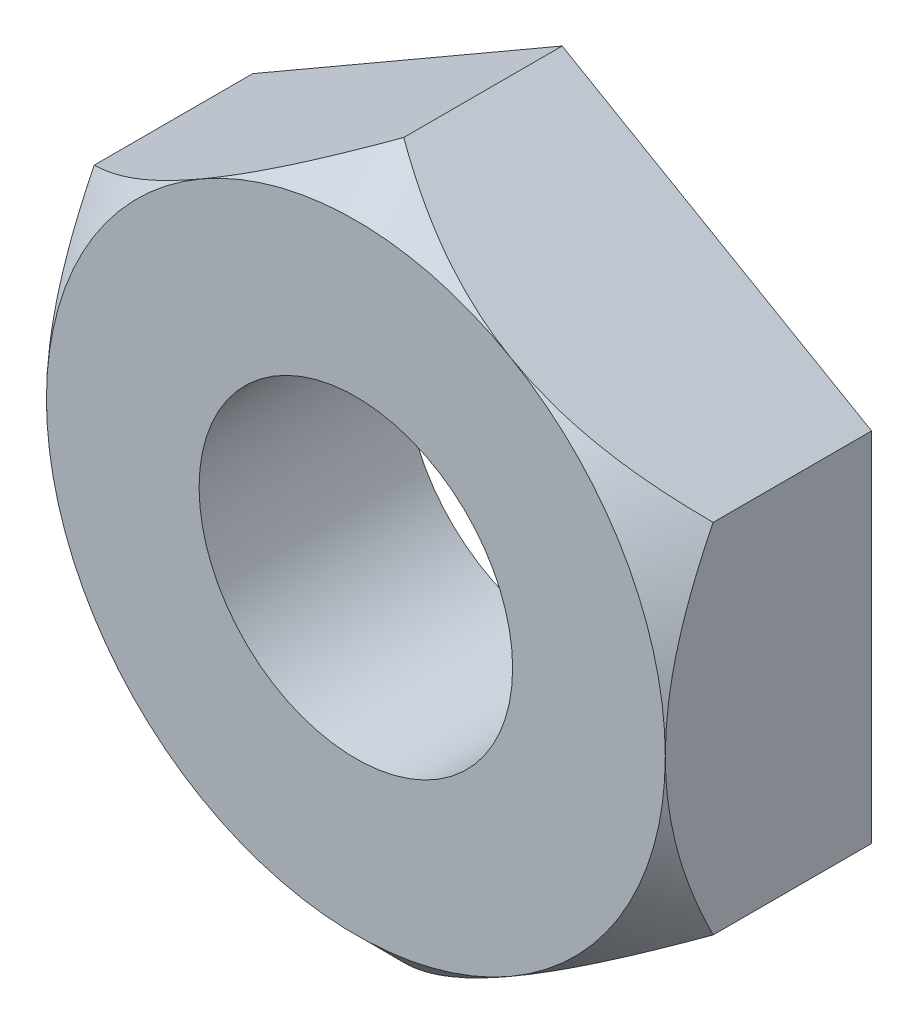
ISO-10303-21;
HEADER;
FILE_DESCRIPTION(('STEP AP214'),'2;1');
FILE_NAME('part.step','',(''),(''),'','','');
FILE_SCHEMA(('AUTOMOTIVE_DESIGN { 1 0 10303 214 1 1 1 1 }'));
ENDSEC;
DATA;
#1=APPLICATION_CONTEXT('core data for automotive mechanical design processes');
#2=APPLICATION_PROTOCOL_DEFINITION('international standard','automotive_design',2000,#1);
#3=PRODUCT_CONTEXT('',#1,'mechanical');
#4=PRODUCT('Part','Part','',(#3));
#5=PRODUCT_RELATED_PRODUCT_CATEGORY('part','',(#4));
#6=PRODUCT_DEFINITION_FORMATION('','',#4);
#7=PRODUCT_DEFINITION_CONTEXT('part definition',#1,'design');
#8=PRODUCT_DEFINITION('design','',#6,#7);
#9=PRODUCT_DEFINITION_SHAPE('','',#8);
#10=(LENGTH_UNIT() NAMED_UNIT(*) SI_UNIT(.MILLI.,.METRE.));
#11=(NAMED_UNIT(*) PLANE_ANGLE_UNIT() SI_UNIT($,.RADIAN.));
#12=(NAMED_UNIT(*) SI_UNIT($,.STERADIAN.) SOLID_ANGLE_UNIT());
#13=UNCERTAINTY_MEASURE_WITH_UNIT(LENGTH_MEASURE(1.E-05),#10,'distance_accuracy_value','');
#14=(GEOMETRIC_REPRESENTATION_CONTEXT(3) GLOBAL_UNCERTAINTY_ASSIGNED_CONTEXT((#13)) GLOBAL_UNIT_ASSIGNED_CONTEXT((#10,
#11,#12)) REPRESENTATION_CONTEXT('',''));
#15=CARTESIAN_POINT('',(0.,0.,0.));
#16=DIRECTION('',(0.,0.,1.));
#17=DIRECTION('',(1.,0.,0.));
#18=AXIS2_PLACEMENT_3D('',#15,#16,#17);
#19=CARTESIAN_POINT('',(4.76249999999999,8.24889197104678,3.175));
#20=DIRECTION('',(0.,0.,1.));
#21=DIRECTION('',(1.,0.,0.));
#22=AXIS2_PLACEMENT_3D('',#19,#20,#21);
#23=PLANE('',#22);
#24=CARTESIAN_POINT('',(0.,0.,3.175));
#25=DIRECTION('',(0.,0.,1.));
#26=DIRECTION('',(1.,0.,0.));
#27=AXIS2_PLACEMENT_3D('',#24,#25,#26);
#28=CIRCLE('',#27,4.7625);
#29=CARTESIAN_POINT('',(2.38125,-4.12444598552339,3.175));
#30=VERTEX_POINT('',#29);
#31=CARTESIAN_POINT('',(4.7625,0.,3.175));
#32=VERTEX_POINT('',#31);
#33=EDGE_CURVE('E139',#30,#32,#28,.T.);
#34=ORIENTED_EDGE('',*,*,#33,.T.);
#35=CARTESIAN_POINT('',(2.38125,4.12444598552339,3.175));
#36=VERTEX_POINT('',#35);
#37=EDGE_CURVE('E122',#32,#36,#28,.T.);
#38=ORIENTED_EDGE('',*,*,#37,.T.);
#39=CARTESIAN_POINT('',(-2.38125,4.12444598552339,3.175));
#40=VERTEX_POINT('',#39);
#41=EDGE_CURVE('E113',#36,#40,#28,.T.);
#42=ORIENTED_EDGE('',*,*,#41,.T.);
#43=CARTESIAN_POINT('',(-4.7625,0.,3.175));
#44=VERTEX_POINT('',#43);
#45=EDGE_CURVE('E123',#40,#44,#28,.T.);
#46=ORIENTED_EDGE('',*,*,#45,.T.);
#47=CARTESIAN_POINT('',(-2.38125,-4.12444598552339,3.175));
#48=VERTEX_POINT('',#47);
#49=EDGE_CURVE('E56',#44,#48,#28,.T.);
#50=ORIENTED_EDGE('',*,*,#49,.T.);
#51=EDGE_CURVE('E64',#48,#30,#28,.T.);
#52=ORIENTED_EDGE('',*,*,#51,.T.);
#53=EDGE_LOOP('',(#34,#38,#42,#46,#50,#52));
#54=FACE_BOUND('',#53,.T.);
#55=CARTESIAN_POINT('',(0.,0.,3.175));
#56=DIRECTION('',(0.,0.,1.));
#57=DIRECTION('',(1.,0.,0.));
#58=AXIS2_PLACEMENT_3D('',#55,#56,#57);
#59=CIRCLE('',#58,2.413);
#60=CARTESIAN_POINT('',(2.413,0.,3.175));
#61=VERTEX_POINT('',#60);
#62=EDGE_CURVE('E244',#61,#61,#59,.T.);
#63=ORIENTED_EDGE('',*,*,#62,.F.);
#64=EDGE_LOOP('',(#63));
#65=FACE_BOUND('',#64,.T.);
#66=ADVANCED_FACE('F34',(#54,#65),#23,.T.);
#67=CARTESIAN_POINT('',(4.76249999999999,8.24889197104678,0.));
#68=DIRECTION('',(0.,0.,1.));
#69=DIRECTION('',(1.,0.,0.));
#70=AXIS2_PLACEMENT_3D('',#67,#68,#69);
#71=PLANE('',#70);
#72=DIRECTION('',(-0.866025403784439,-0.5,0.));
#73=VECTOR('',#72,1.);
#74=CARTESIAN_POINT('',(0.,5.49926131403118,0.));
#75=LINE('',#74,#73);
#76=CARTESIAN_POINT('',(0.,5.49926131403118,0.));
#77=VERTEX_POINT('',#76);
#78=CARTESIAN_POINT('',(-4.7625,2.74963065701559,0.));
#79=VERTEX_POINT('',#78);
#80=EDGE_CURVE('E239',#77,#79,#75,.T.);
#81=ORIENTED_EDGE('',*,*,#80,.F.);
#82=DIRECTION('',(0.866025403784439,-0.5,0.));
#83=VECTOR('',#82,1.);
#84=CARTESIAN_POINT('',(0.,5.49926131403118,0.));
#85=LINE('',#84,#83);
#86=CARTESIAN_POINT('',(4.7625,2.74963065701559,0.));
#87=VERTEX_POINT('',#86);
#88=EDGE_CURVE('E225',#77,#87,#85,.T.);
#89=ORIENTED_EDGE('',*,*,#88,.T.);
#90=DIRECTION('',(0.,-1.,0.));
#91=VECTOR('',#90,1.);
#92=CARTESIAN_POINT('',(4.7625,2.74963065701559,0.));
#93=LINE('',#92,#91);
#94=CARTESIAN_POINT('',(4.7625,-2.74963065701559,0.));
#95=VERTEX_POINT('',#94);
#96=EDGE_CURVE('E220',#87,#95,#93,.T.);
#97=ORIENTED_EDGE('',*,*,#96,.T.);
#98=DIRECTION('',(0.866025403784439,0.5,0.));
#99=VECTOR('',#98,1.);
#100=CARTESIAN_POINT('',(0.,-5.49926131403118,0.));
#101=LINE('',#100,#99);
#102=CARTESIAN_POINT('',(0.,-5.49926131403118,0.));
#103=VERTEX_POINT('',#102);
#104=EDGE_CURVE('E249',#103,#95,#101,.T.);
#105=ORIENTED_EDGE('',*,*,#104,.F.);
#106=DIRECTION('',(-0.866025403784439,0.5,0.));
#107=VECTOR('',#106,1.);
#108=CARTESIAN_POINT('',(0.,-5.49926131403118,0.));
#109=LINE('',#108,#107);
#110=CARTESIAN_POINT('',(-4.7625,-2.74963065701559,0.));
#111=VERTEX_POINT('',#110);
#112=EDGE_CURVE('E242',#103,#111,#109,.T.);
#113=ORIENTED_EDGE('',*,*,#112,.T.);
#114=DIRECTION('',(0.,-1.,0.));
#115=VECTOR('',#114,1.);
#116=CARTESIAN_POINT('',(-4.7625,2.74963065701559,0.));
#117=LINE('',#116,#115);
#118=EDGE_CURVE('E231',#79,#111,#117,.T.);
#119=ORIENTED_EDGE('',*,*,#118,.F.);
#120=EDGE_LOOP('',(#81,#89,#97,#105,#113,#119));
#121=FACE_BOUND('',#120,.T.);
#122=CARTESIAN_POINT('',(0.,0.,0.));
#123=DIRECTION('',(0.,0.,1.));
#124=DIRECTION('',(1.,0.,0.));
#125=AXIS2_PLACEMENT_3D('',#122,#123,#124);
#126=CIRCLE('',#125,2.413);
#127=CARTESIAN_POINT('',(2.413,0.,0.));
#128=VERTEX_POINT('',#127);
#129=EDGE_CURVE('E150',#128,#128,#126,.T.);
#130=ORIENTED_EDGE('',*,*,#129,.T.);
#131=EDGE_LOOP('',(#130));
#132=FACE_BOUND('',#131,.T.);
#133=ADVANCED_FACE('F237',(#121,#132),#71,.F.);
#134=CARTESIAN_POINT('',(0.,5.49926131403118,3.175));
#135=DIRECTION('',(0.5,-0.866025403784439,0.));
#136=DIRECTION('',(0.866025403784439,0.5,0.));
#137=AXIS2_PLACEMENT_3D('',#134,#135,#136);
#138=PLANE('',#137);
#139=CARTESIAN_POINT('',(0.000200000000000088,5.49937678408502,2.4381232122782));
#140=CARTESIAN_POINT('',(-0.0816893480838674,5.45209794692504,2.48539793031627));
#141=CARTESIAN_POINT('',(-0.164208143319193,5.40445569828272,2.53122188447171));
#142=CARTESIAN_POINT('',(-0.330628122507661,5.30837307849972,2.61952693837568));
#143=CARTESIAN_POINT('',(-0.414530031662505,5.25993228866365,2.66200621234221));
#144=CARTESIAN_POINT('',(-0.669275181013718,5.11285510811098,2.78412729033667));
#145=CARTESIAN_POINT('',(-0.842275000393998,5.01297361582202,2.85793135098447));
#146=CARTESIAN_POINT('',(-1.1911430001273,4.81155458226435,2.98431583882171));
#147=CARTESIAN_POINT('',(-1.36692200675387,4.71006852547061,3.03721468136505));
#148=CARTESIAN_POINT('',(-1.63348047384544,4.55617092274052,3.09840573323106));
#149=CARTESIAN_POINT('',(-1.722725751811,4.5046451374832,3.11576836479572));
#150=CARTESIAN_POINT('',(-1.90197198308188,4.40115727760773,3.14404831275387));
#151=CARTESIAN_POINT('',(-1.99197282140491,4.34919526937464,3.15496659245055));
#152=CARTESIAN_POINT('',(-2.21129017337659,4.22257233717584,3.17327251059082));
#153=CARTESIAN_POINT('',(-2.34084298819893,4.14777498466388,3.17711359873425));
#154=CARTESIAN_POINT('',(-2.59971514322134,3.998315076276,3.17066760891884));
#155=CARTESIAN_POINT('',(-2.7290343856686,3.92365257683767,3.16037557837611));
#156=CARTESIAN_POINT('',(-2.98645369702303,3.77503146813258,3.1262700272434));
#157=CARTESIAN_POINT('',(-3.11455223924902,3.70107374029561,3.10244138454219));
#158=CARTESIAN_POINT('',(-3.36854763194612,3.55442943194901,3.0425580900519));
#159=CARTESIAN_POINT('',(-3.49444465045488,3.48174275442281,3.00650437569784));
#160=CARTESIAN_POINT('',(-3.71793882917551,3.35270833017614,2.93232926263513));
#161=CARTESIAN_POINT('',(-3.8160307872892,3.29607491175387,2.89615832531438));
#162=CARTESIAN_POINT('',(-4.01045375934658,3.18382475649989,2.8179873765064));
#163=CARTESIAN_POINT('',(-4.10678471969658,3.12820805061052,2.7759871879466));
#164=CARTESIAN_POINT('',(-4.29738229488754,3.01816648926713,2.68709929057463));
#165=CARTESIAN_POINT('',(-4.39165433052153,2.96373850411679,2.64022695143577));
#166=CARTESIAN_POINT('',(-4.57845266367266,2.85589043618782,2.54221019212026));
#167=CARTESIAN_POINT('',(-4.67097998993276,2.80246975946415,2.49106839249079));
#168=CARTESIAN_POINT('',(-4.7627,2.74951518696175,2.4381232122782));
#169=B_SPLINE_CURVE_WITH_KNOTS('',3,(#139,#140,#141,#142,#143,#144,#145,#146,#147,#148,#149,
#150,#151,#152,#153,#154,#155,#156,#157,#158,#159,#160,#161,#162,#163,#164,#165,#166,#167,#168),
.UNSPECIFIED.,.F.,.F.,(4,2,2,2,2,2,2,2,2,2,2,2,2,2,4),(0.,0.317131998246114,0.634435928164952,
1.27246967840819,1.90037160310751,2.21370673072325,2.52699500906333,2.97522950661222,
3.42362111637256,3.87251462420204,4.32137371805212,4.67791268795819,5.03446249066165,
5.38991982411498,5.74516056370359),.UNSPECIFIED.);
#170=CARTESIAN_POINT('',(0.,5.49926131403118,2.43823868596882));
#171=VERTEX_POINT('',#170);
#172=EDGE_CURVE('E117',#171,#40,#169,.T.);
#173=ORIENTED_EDGE('',*,*,#172,.F.);
#174=DIRECTION('',(0.,0.,-1.));
#175=VECTOR('',#174,1.);
#176=CARTESIAN_POINT('',(0.,5.49926131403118,3.175));
#177=LINE('',#176,#175);
#178=EDGE_CURVE('E137',#171,#77,#177,.T.);
#179=ORIENTED_EDGE('',*,*,#178,.T.);
#180=ORIENTED_EDGE('',*,*,#80,.T.);
#181=DIRECTION('',(0.,0.,-1.));
#182=VECTOR('',#181,1.);
#183=CARTESIAN_POINT('',(-4.7625,2.74963065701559,3.175));
#184=LINE('',#183,#182);
#185=CARTESIAN_POINT('',(-4.7625,2.74963065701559,2.43823868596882));
#186=VERTEX_POINT('',#185);
#187=EDGE_CURVE('E133',#186,#79,#184,.T.);
#188=ORIENTED_EDGE('',*,*,#187,.F.);
#189=EDGE_CURVE('E144',#40,#186,#169,.T.);
#190=ORIENTED_EDGE('',*,*,#189,.F.);
#191=EDGE_LOOP('',(#173,#179,#180,#188,#190));
#192=FACE_BOUND('',#191,.T.);
#193=ADVANCED_FACE('F36',(#192),#138,.F.);
#194=CARTESIAN_POINT('',(-4.7625,2.74963065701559,3.175));
#195=DIRECTION('',(1.,0.,0.));
#196=DIRECTION('',(0.,1.,0.));
#197=AXIS2_PLACEMENT_3D('',#194,#195,#196);
#198=PLANE('',#197);
#199=CARTESIAN_POINT('',(-4.7625,-6.94942286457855,-0.487218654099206));
#200=CARTESIAN_POINT('',(-4.7625,-6.77451514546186,-0.342976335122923));
#201=CARTESIAN_POINT('',(-4.7625,-6.59877988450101,-0.199721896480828));
#202=CARTESIAN_POINT('',(-4.7625,-6.24522692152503,0.0842830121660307));
#203=CARTESIAN_POINT('',(-4.7625,-6.0674087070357,0.225032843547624));
#204=CARTESIAN_POINT('',(-4.7625,-5.70737246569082,0.504964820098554));
#205=CARTESIAN_POINT('',(-4.7625,-5.52512753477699,0.644112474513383));
#206=CARTESIAN_POINT('',(-4.7625,-5.15765922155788,0.918390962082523));
#207=CARTESIAN_POINT('',(-4.7625,-4.97243613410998,1.05352218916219));
#208=CARTESIAN_POINT('',(-4.7625,-4.58022843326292,1.33152392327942));
#209=CARTESIAN_POINT('',(-4.7625,-4.37287411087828,1.47387578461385));
#210=CARTESIAN_POINT('',(-4.7625,-3.9526557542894,1.75042966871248));
#211=CARTESIAN_POINT('',(-4.7625,-3.739789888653,1.88462893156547));
#212=CARTESIAN_POINT('',(-4.7625,-3.3083543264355,2.14123770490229));
#213=CARTESIAN_POINT('',(-4.7625,-3.08981600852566,2.26369948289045));
#214=CARTESIAN_POINT('',(-4.7625,-2.644861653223,2.49320028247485));
#215=CARTESIAN_POINT('',(-4.7625,-2.41845284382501,2.60025301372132));
#216=CARTESIAN_POINT('',(-4.7625,-2.02508952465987,2.76442947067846));
#217=CARTESIAN_POINT('',(-4.7625,-1.86040273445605,2.82694738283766));
#218=CARTESIAN_POINT('',(-4.7625,-1.5265118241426,2.93880856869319));
#219=CARTESIAN_POINT('',(-4.7625,-1.35730709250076,2.9881500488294));
#220=CARTESIAN_POINT('',(-4.7625,-1.01885758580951,3.06993762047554));
#221=CARTESIAN_POINT('',(-4.7625,-0.849700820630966,3.1027416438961));
#222=CARTESIAN_POINT('',(-4.7625,-0.508900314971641,3.15085398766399));
#223=CARTESIAN_POINT('',(-4.7625,-0.337257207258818,3.16616668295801));
#224=CARTESIAN_POINT('',(-4.7625,-0.00272248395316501,3.17777230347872));
#225=CARTESIAN_POINT('',(-4.7625,0.160134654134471,3.175059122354));
#226=CARTESIAN_POINT('',(-4.7625,0.48472452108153,3.15313678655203));
#227=CARTESIAN_POINT('',(-4.7625,0.646457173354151,3.13392651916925));
#228=CARTESIAN_POINT('',(-4.7625,0.970457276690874,3.07980923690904));
#229=CARTESIAN_POINT('',(-4.7625,1.13267409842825,3.04460458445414));
#230=CARTESIAN_POINT('',(-4.7625,1.45346992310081,2.96055418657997));
#231=CARTESIAN_POINT('',(-4.7625,1.61204896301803,2.91170857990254));
#232=CARTESIAN_POINT('',(-4.7625,1.9280436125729,2.8017033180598));
#233=CARTESIAN_POINT('',(-4.7625,2.08538631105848,2.74033693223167));
#234=CARTESIAN_POINT('',(-4.7625,2.39605277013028,2.60808141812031));
#235=CARTESIAN_POINT('',(-4.7625,2.54937474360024,2.53718813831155));
#236=CARTESIAN_POINT('',(-4.7625,2.85270151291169,2.38755831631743));
#237=CARTESIAN_POINT('',(-4.7625,3.00269456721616,2.30879816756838));
#238=CARTESIAN_POINT('',(-4.7625,3.29925462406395,2.1451603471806));
#239=CARTESIAN_POINT('',(-4.7625,3.44582213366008,2.06028358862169));
#240=CARTESIAN_POINT('',(-4.7625,3.72880104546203,1.88991832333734));
#241=CARTESIAN_POINT('',(-4.7625,3.8653563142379,1.80466751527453));
#242=CARTESIAN_POINT('',(-4.7625,4.13612037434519,1.63050715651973));
#243=CARTESIAN_POINT('',(-4.7625,4.27032899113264,1.54159733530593));
#244=CARTESIAN_POINT('',(-4.7625,4.53563818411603,1.36148366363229));
#245=CARTESIAN_POINT('',(-4.7625,4.66675496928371,1.27030360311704));
#246=CARTESIAN_POINT('',(-4.7625,4.92718552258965,1.08547603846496));
#247=CARTESIAN_POINT('',(-4.7625,5.05649977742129,0.991829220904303));
#248=CARTESIAN_POINT('',(-4.7625,5.1850568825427,0.897171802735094));
#249=B_SPLINE_CURVE_WITH_KNOTS('',3,(#199,#200,#201,#202,#203,#204,#205,#206,#207,#208,#209,
#210,#211,#212,#213,#214,#215,#216,#217,#218,#219,#220,#221,#222,#223,#224,#225,#226,#227,#228,
#229,#230,#231,#232,#233,#234,#235,#236,#237,#238,#239,#240,#241,#242,#243,#244,#245,#246,#247,
#248),.UNSPECIFIED.,.F.,.F.,(4,2,2,2,2,2,2,2,2,2,2,2,2,2,2,2,2,2,2,2,2,2,2,2,4),(0.,
0.680148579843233,1.36046816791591,2.04830265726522,2.73606946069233,3.4904716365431,
4.2451277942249,4.99624995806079,5.74669965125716,6.27472318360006,6.80281855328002,
7.31893222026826,7.8349167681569,8.32269691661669,8.81050996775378,9.3077980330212,
9.8050810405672,10.3113577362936,10.8178557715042,11.3259221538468,11.8339128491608,
12.316789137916,12.7997011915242,13.2787828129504,13.7577324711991),.UNSPECIFIED.);
#250=EDGE_CURVE('E146',#186,#44,#249,.F.);
#251=ORIENTED_EDGE('',*,*,#250,.F.);
#252=ORIENTED_EDGE('',*,*,#187,.T.);
#253=ORIENTED_EDGE('',*,*,#118,.T.);
#254=DIRECTION('',(0.,0.,-1.));
#255=VECTOR('',#254,1.);
#256=CARTESIAN_POINT('',(-4.7625,-2.74963065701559,3.175));
#257=LINE('',#256,#255);
#258=CARTESIAN_POINT('',(-4.7625,-2.74963065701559,2.43823868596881));
#259=VERTEX_POINT('',#258);
#260=EDGE_CURVE('E156',#259,#111,#257,.T.);
#261=ORIENTED_EDGE('',*,*,#260,.F.);
#262=EDGE_CURVE('E151',#44,#259,#249,.F.);
#263=ORIENTED_EDGE('',*,*,#262,.F.);
#264=EDGE_LOOP('',(#251,#252,#253,#261,#263));
#265=FACE_BOUND('',#264,.T.);
#266=ADVANCED_FACE('F154',(#265),#198,.F.);
#267=CARTESIAN_POINT('',(0.,-5.49926131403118,3.175));
#268=DIRECTION('',(-0.5,-0.866025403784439,0.));
#269=DIRECTION('',(0.866025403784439,-0.5,0.));
#270=AXIS2_PLACEMENT_3D('',#267,#268,#269);
#271=PLANE('',#270);
#272=DIRECTION('',(0.,0.,-1.));
#273=VECTOR('',#272,1.);
#274=CARTESIAN_POINT('',(0.,-5.49926131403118,3.175));
#275=LINE('',#274,#273);
#276=CARTESIAN_POINT('',(0.,-5.49926131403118,2.43823868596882));
#277=VERTEX_POINT('',#276);
#278=EDGE_CURVE('E223',#277,#103,#275,.T.);
#279=ORIENTED_EDGE('',*,*,#278,.F.);
#280=CARTESIAN_POINT('',(0.000199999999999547,-5.49937678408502,2.4381232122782));
#281=CARTESIAN_POINT('',(-0.081689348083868,-5.45209794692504,2.48539793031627));
#282=CARTESIAN_POINT('',(-0.164208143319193,-5.40445569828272,2.53122188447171));
#283=CARTESIAN_POINT('',(-0.330628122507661,-5.30837307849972,2.61952693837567));
#284=CARTESIAN_POINT('',(-0.414530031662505,-5.25993228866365,2.66200621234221));
#285=CARTESIAN_POINT('',(-0.669275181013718,-5.11285510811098,2.78412729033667));
#286=CARTESIAN_POINT('',(-0.842275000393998,-5.01297361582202,2.85793135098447));
#287=CARTESIAN_POINT('',(-1.1911430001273,-4.81155458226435,2.98431583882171));
#288=CARTESIAN_POINT('',(-1.36692200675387,-4.71006852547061,3.03721468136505));
#289=CARTESIAN_POINT('',(-1.63348047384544,-4.55617092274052,3.09840573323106));
#290=CARTESIAN_POINT('',(-1.722725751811,-4.5046451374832,3.11576836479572));
#291=CARTESIAN_POINT('',(-1.90197198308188,-4.40115727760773,3.14404831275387));
#292=CARTESIAN_POINT('',(-1.99197282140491,-4.34919526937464,3.15496659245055));
#293=CARTESIAN_POINT('',(-2.21129017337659,-4.22257233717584,3.17327251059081));
#294=CARTESIAN_POINT('',(-2.34084298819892,-4.14777498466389,3.17711359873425));
#295=CARTESIAN_POINT('',(-2.59971514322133,-3.998315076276,3.17066760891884));
#296=CARTESIAN_POINT('',(-2.7290343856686,-3.92365257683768,3.16037557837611));
#297=CARTESIAN_POINT('',(-2.98645369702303,-3.77503146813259,3.1262700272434));
#298=CARTESIAN_POINT('',(-3.11455223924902,-3.70107374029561,3.10244138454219));
#299=CARTESIAN_POINT('',(-3.36854763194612,-3.55442943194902,3.0425580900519));
#300=CARTESIAN_POINT('',(-3.49444465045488,-3.48174275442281,3.00650437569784));
#301=CARTESIAN_POINT('',(-3.71793882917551,-3.35270833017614,2.93232926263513));
#302=CARTESIAN_POINT('',(-3.8160307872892,-3.29607491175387,2.89615832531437));
#303=CARTESIAN_POINT('',(-4.01045375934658,-3.18382475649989,2.81798737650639));
#304=CARTESIAN_POINT('',(-4.10678471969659,-3.12820805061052,2.77598718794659));
#305=CARTESIAN_POINT('',(-4.29738229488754,-3.01816648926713,2.68709929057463));
#306=CARTESIAN_POINT('',(-4.39165433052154,-2.96373850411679,2.64022695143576));
#307=CARTESIAN_POINT('',(-4.57845266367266,-2.85589043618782,2.54221019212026));
#308=CARTESIAN_POINT('',(-4.67097998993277,-2.80246975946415,2.49106839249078));
#309=CARTESIAN_POINT('',(-4.7627,-2.74951518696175,2.4381232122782));
#310=B_SPLINE_CURVE_WITH_KNOTS('',3,(#280,#281,#282,#283,#284,#285,#286,#287,#288,#289,#290,
#291,#292,#293,#294,#295,#296,#297,#298,#299,#300,#301,#302,#303,#304,#305,#306,#307,#308,#309),
.UNSPECIFIED.,.F.,.F.,(4,2,2,2,2,2,2,2,2,2,2,2,2,2,4),(0.,0.317131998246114,0.634435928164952,
1.27246967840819,1.90037160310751,2.21370673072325,2.52699500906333,2.97522950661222,
3.42362111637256,3.87251462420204,4.32137371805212,4.67791268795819,5.03446249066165,
5.38991982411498,5.74516056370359),.UNSPECIFIED.);
#311=EDGE_CURVE('E160',#277,#48,#310,.T.);
#312=ORIENTED_EDGE('',*,*,#311,.T.);
#313=EDGE_CURVE('E158',#48,#259,#310,.T.);
#314=ORIENTED_EDGE('',*,*,#313,.T.);
#315=ORIENTED_EDGE('',*,*,#260,.T.);
#316=ORIENTED_EDGE('',*,*,#112,.F.);
#317=EDGE_LOOP('',(#279,#312,#314,#315,#316));
#318=FACE_BOUND('',#317,.T.);
#319=ADVANCED_FACE('F177',(#318),#271,.T.);
#320=CARTESIAN_POINT('',(0.,-5.49926131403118,3.175));
#321=DIRECTION('',(-0.5,0.866025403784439,0.));
#322=DIRECTION('',(-0.866025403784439,-0.5,0.));
#323=AXIS2_PLACEMENT_3D('',#320,#321,#322);
#324=PLANE('',#323);
#325=CARTESIAN_POINT('',(-0.000200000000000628,-5.49937678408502,2.4381232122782));
#326=CARTESIAN_POINT('',(0.0816893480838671,-5.45209794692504,2.48539793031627));
#327=CARTESIAN_POINT('',(0.164208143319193,-5.40445569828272,2.53122188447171));
#328=CARTESIAN_POINT('',(0.330628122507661,-5.30837307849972,2.61952693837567));
#329=CARTESIAN_POINT('',(0.414530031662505,-5.25993228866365,2.66200621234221));
#330=CARTESIAN_POINT('',(0.669275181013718,-5.11285510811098,2.78412729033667));
#331=CARTESIAN_POINT('',(0.842275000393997,-5.01297361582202,2.85793135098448));
#332=CARTESIAN_POINT('',(1.1911430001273,-4.81155458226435,2.98431583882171));
#333=CARTESIAN_POINT('',(1.36692200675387,-4.71006852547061,3.03721468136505));
#334=CARTESIAN_POINT('',(1.63348047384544,-4.55617092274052,3.09840573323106));
#335=CARTESIAN_POINT('',(1.722725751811,-4.5046451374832,3.11576836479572));
#336=CARTESIAN_POINT('',(1.90197198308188,-4.40115727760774,3.14404831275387));
#337=CARTESIAN_POINT('',(1.99197282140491,-4.34919526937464,3.15496659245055));
#338=CARTESIAN_POINT('',(2.21129017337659,-4.22257233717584,3.17327251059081));
#339=CARTESIAN_POINT('',(2.34084298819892,-4.14777498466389,3.17711359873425));
#340=CARTESIAN_POINT('',(2.59971514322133,-3.998315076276,3.17066760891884));
#341=CARTESIAN_POINT('',(2.7290343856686,-3.92365257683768,3.16037557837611));
#342=CARTESIAN_POINT('',(2.98645369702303,-3.77503146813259,3.1262700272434));
#343=CARTESIAN_POINT('',(3.11455223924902,-3.70107374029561,3.10244138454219));
#344=CARTESIAN_POINT('',(3.36854763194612,-3.55442943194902,3.0425580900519));
#345=CARTESIAN_POINT('',(3.49444465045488,-3.48174275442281,3.00650437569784));
#346=CARTESIAN_POINT('',(3.7179388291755,-3.35270833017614,2.93232926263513));
#347=CARTESIAN_POINT('',(3.8160307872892,-3.29607491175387,2.89615832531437));
#348=CARTESIAN_POINT('',(4.01045375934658,-3.18382475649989,2.81798737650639));
#349=CARTESIAN_POINT('',(4.10678471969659,-3.12820805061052,2.7759871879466));
#350=CARTESIAN_POINT('',(4.29738229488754,-3.01816648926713,2.68709929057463));
#351=CARTESIAN_POINT('',(4.39165433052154,-2.96373850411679,2.64022695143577));
#352=CARTESIAN_POINT('',(4.57845266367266,-2.85589043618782,2.54221019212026));
#353=CARTESIAN_POINT('',(4.67097998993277,-2.80246975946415,2.49106839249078));
#354=CARTESIAN_POINT('',(4.7627,-2.74951518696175,2.4381232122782));
#355=B_SPLINE_CURVE_WITH_KNOTS('',3,(#325,#326,#327,#328,#329,#330,#331,#332,#333,#334,#335,
#336,#337,#338,#339,#340,#341,#342,#343,#344,#345,#346,#347,#348,#349,#350,#351,#352,#353,#354),
.UNSPECIFIED.,.F.,.F.,(4,2,2,2,2,2,2,2,2,2,2,2,2,2,4),(0.,0.317131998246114,0.634435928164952,
1.27246967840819,1.90037160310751,2.21370673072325,2.52699500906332,2.97522950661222,
3.42362111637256,3.87251462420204,4.32137371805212,4.67791268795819,5.03446249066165,
5.38991982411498,5.7451605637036),.UNSPECIFIED.);
#356=EDGE_CURVE('E195',#277,#30,#355,.T.);
#357=ORIENTED_EDGE('',*,*,#356,.F.);
#358=ORIENTED_EDGE('',*,*,#278,.T.);
#359=ORIENTED_EDGE('',*,*,#104,.T.);
#360=DIRECTION('',(0.,0.,-1.));
#361=VECTOR('',#360,1.);
#362=CARTESIAN_POINT('',(4.7625,-2.74963065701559,3.175));
#363=LINE('',#362,#361);
#364=CARTESIAN_POINT('',(4.7625,-2.74963065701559,2.43823868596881));
#365=VERTEX_POINT('',#364);
#366=EDGE_CURVE('E212',#365,#95,#363,.T.);
#367=ORIENTED_EDGE('',*,*,#366,.F.);
#368=EDGE_CURVE('E189',#30,#365,#355,.T.);
#369=ORIENTED_EDGE('',*,*,#368,.F.);
#370=EDGE_LOOP('',(#357,#358,#359,#367,#369));
#371=FACE_BOUND('',#370,.T.);
#372=ADVANCED_FACE('F181',(#371),#324,.F.);
#373=CARTESIAN_POINT('',(4.7625,2.74963065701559,3.175));
#374=DIRECTION('',(1.,0.,0.));
#375=DIRECTION('',(0.,1.,0.));
#376=AXIS2_PLACEMENT_3D('',#373,#374,#375);
#377=PLANE('',#376);
#378=DIRECTION('',(0.,0.,-1.));
#379=VECTOR('',#378,1.);
#380=CARTESIAN_POINT('',(4.7625,2.74963065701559,3.175));
#381=LINE('',#380,#379);
#382=CARTESIAN_POINT('',(4.7625,2.74963065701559,2.43823868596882));
#383=VERTEX_POINT('',#382);
#384=EDGE_CURVE('E218',#383,#87,#381,.T.);
#385=ORIENTED_EDGE('',*,*,#384,.F.);
#386=CARTESIAN_POINT('',(4.7625,-6.94942286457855,-0.487218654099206));
#387=CARTESIAN_POINT('',(4.7625,-6.77451514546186,-0.342976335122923));
#388=CARTESIAN_POINT('',(4.7625,-6.59877988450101,-0.199721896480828));
#389=CARTESIAN_POINT('',(4.7625,-6.24522692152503,0.0842830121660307));
#390=CARTESIAN_POINT('',(4.7625,-6.0674087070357,0.225032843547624));
#391=CARTESIAN_POINT('',(4.7625,-5.70737246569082,0.504964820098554));
#392=CARTESIAN_POINT('',(4.7625,-5.52512753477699,0.644112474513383));
#393=CARTESIAN_POINT('',(4.7625,-5.15765922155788,0.918390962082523));
#394=CARTESIAN_POINT('',(4.7625,-4.97243613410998,1.05352218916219));
#395=CARTESIAN_POINT('',(4.7625,-4.58022843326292,1.33152392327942));
#396=CARTESIAN_POINT('',(4.7625,-4.37287411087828,1.47387578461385));
#397=CARTESIAN_POINT('',(4.7625,-3.9526557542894,1.75042966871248));
#398=CARTESIAN_POINT('',(4.7625,-3.739789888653,1.88462893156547));
#399=CARTESIAN_POINT('',(4.7625,-3.3083543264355,2.14123770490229));
#400=CARTESIAN_POINT('',(4.7625,-3.08981600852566,2.26369948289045));
#401=CARTESIAN_POINT('',(4.7625,-2.644861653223,2.49320028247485));
#402=CARTESIAN_POINT('',(4.7625,-2.41845284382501,2.60025301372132));
#403=CARTESIAN_POINT('',(4.7625,-2.02508952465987,2.76442947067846));
#404=CARTESIAN_POINT('',(4.7625,-1.86040273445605,2.82694738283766));
#405=CARTESIAN_POINT('',(4.7625,-1.5265118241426,2.93880856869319));
#406=CARTESIAN_POINT('',(4.7625,-1.35730709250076,2.9881500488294));
#407=CARTESIAN_POINT('',(4.7625,-1.01885758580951,3.06993762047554));
#408=CARTESIAN_POINT('',(4.7625,-0.849700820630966,3.1027416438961));
#409=CARTESIAN_POINT('',(4.7625,-0.508900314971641,3.15085398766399));
#410=CARTESIAN_POINT('',(4.7625,-0.337257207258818,3.16616668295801));
#411=CARTESIAN_POINT('',(4.7625,-0.00272248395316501,3.17777230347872));
#412=CARTESIAN_POINT('',(4.7625,0.160134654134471,3.175059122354));
#413=CARTESIAN_POINT('',(4.7625,0.48472452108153,3.15313678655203));
#414=CARTESIAN_POINT('',(4.7625,0.646457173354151,3.13392651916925));
#415=CARTESIAN_POINT('',(4.7625,0.970457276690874,3.07980923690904));
#416=CARTESIAN_POINT('',(4.7625,1.13267409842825,3.04460458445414));
#417=CARTESIAN_POINT('',(4.7625,1.45346992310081,2.96055418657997));
#418=CARTESIAN_POINT('',(4.7625,1.61204896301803,2.91170857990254));
#419=CARTESIAN_POINT('',(4.7625,1.9280436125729,2.8017033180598));
#420=CARTESIAN_POINT('',(4.7625,2.08538631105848,2.74033693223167));
#421=CARTESIAN_POINT('',(4.7625,2.39605277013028,2.60808141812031));
#422=CARTESIAN_POINT('',(4.7625,2.54937474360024,2.53718813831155));
#423=CARTESIAN_POINT('',(4.7625,2.85270151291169,2.38755831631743));
#424=CARTESIAN_POINT('',(4.7625,3.00269456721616,2.30879816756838));
#425=CARTESIAN_POINT('',(4.7625,3.29925462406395,2.1451603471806));
#426=CARTESIAN_POINT('',(4.7625,3.44582213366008,2.06028358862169));
#427=CARTESIAN_POINT('',(4.7625,3.72880104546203,1.88991832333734));
#428=CARTESIAN_POINT('',(4.7625,3.8653563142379,1.80466751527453));
#429=CARTESIAN_POINT('',(4.7625,4.13612037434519,1.63050715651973));
#430=CARTESIAN_POINT('',(4.7625,4.27032899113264,1.54159733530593));
#431=CARTESIAN_POINT('',(4.7625,4.53563818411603,1.36148366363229));
#432=CARTESIAN_POINT('',(4.7625,4.66675496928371,1.27030360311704));
#433=CARTESIAN_POINT('',(4.7625,4.92718552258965,1.08547603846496));
#434=CARTESIAN_POINT('',(4.7625,5.05649977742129,0.991829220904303));
#435=CARTESIAN_POINT('',(4.7625,5.1850568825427,0.897171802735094));
#436=B_SPLINE_CURVE_WITH_KNOTS('',3,(#386,#387,#388,#389,#390,#391,#392,#393,#394,#395,#396,
#397,#398,#399,#400,#401,#402,#403,#404,#405,#406,#407,#408,#409,#410,#411,#412,#413,#414,#415,
#416,#417,#418,#419,#420,#421,#422,#423,#424,#425,#426,#427,#428,#429,#430,#431,#432,#433,#434,
#435),.UNSPECIFIED.,.F.,.F.,(4,2,2,2,2,2,2,2,2,2,2,2,2,2,2,2,2,2,2,2,2,2,2,2,4),(0.,
0.680148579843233,1.36046816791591,2.04830265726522,2.73606946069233,3.4904716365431,
4.2451277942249,4.99624995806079,5.74669965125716,6.27472318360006,6.80281855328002,
7.31893222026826,7.8349167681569,8.32269691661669,8.81050996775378,9.3077980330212,
9.8050810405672,10.3113577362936,10.8178557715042,11.3259221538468,11.8339128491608,
12.316789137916,12.7997011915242,13.2787828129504,13.7577324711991),.UNSPECIFIED.);
#437=EDGE_CURVE('E130',#383,#32,#436,.F.);
#438=ORIENTED_EDGE('',*,*,#437,.T.);
#439=EDGE_CURVE('E141',#32,#365,#436,.F.);
#440=ORIENTED_EDGE('',*,*,#439,.T.);
#441=ORIENTED_EDGE('',*,*,#366,.T.);
#442=ORIENTED_EDGE('',*,*,#96,.F.);
#443=EDGE_LOOP('',(#385,#438,#440,#441,#442));
#444=FACE_BOUND('',#443,.T.);
#445=ADVANCED_FACE('F186',(#444),#377,.T.);
#446=CARTESIAN_POINT('',(0.,5.49926131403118,3.175));
#447=DIRECTION('',(0.5,0.866025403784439,0.));
#448=DIRECTION('',(-0.866025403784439,0.5,0.));
#449=AXIS2_PLACEMENT_3D('',#446,#447,#448);
#450=PLANE('',#449);
#451=ORIENTED_EDGE('',*,*,#178,.F.);
#452=CARTESIAN_POINT('',(-0.000200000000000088,5.49937678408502,2.4381232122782));
#453=CARTESIAN_POINT('',(0.0816893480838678,5.45209794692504,2.48539793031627));
#454=CARTESIAN_POINT('',(0.164208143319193,5.40445569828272,2.53122188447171));
#455=CARTESIAN_POINT('',(0.330628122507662,5.30837307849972,2.61952693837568));
#456=CARTESIAN_POINT('',(0.414530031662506,5.25993228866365,2.66200621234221));
#457=CARTESIAN_POINT('',(0.669275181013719,5.11285510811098,2.78412729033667));
#458=CARTESIAN_POINT('',(0.842275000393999,5.01297361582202,2.85793135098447));
#459=CARTESIAN_POINT('',(1.1911430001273,4.81155458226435,2.98431583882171));
#460=CARTESIAN_POINT('',(1.36692200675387,4.71006852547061,3.03721468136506));
#461=CARTESIAN_POINT('',(1.63348047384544,4.55617092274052,3.09840573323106));
#462=CARTESIAN_POINT('',(1.722725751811,4.5046451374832,3.11576836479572));
#463=CARTESIAN_POINT('',(1.90197198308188,4.40115727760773,3.14404831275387));
#464=CARTESIAN_POINT('',(1.99197282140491,4.34919526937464,3.15496659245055));
#465=CARTESIAN_POINT('',(2.21129017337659,4.22257233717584,3.17327251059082));
#466=CARTESIAN_POINT('',(2.34084298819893,4.14777498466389,3.17711359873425));
#467=CARTESIAN_POINT('',(2.59971514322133,3.998315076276,3.17066760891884));
#468=CARTESIAN_POINT('',(2.7290343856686,3.92365257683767,3.16037557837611));
#469=CARTESIAN_POINT('',(2.98645369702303,3.77503146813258,3.1262700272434));
#470=CARTESIAN_POINT('',(3.11455223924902,3.70107374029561,3.10244138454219));
#471=CARTESIAN_POINT('',(3.36854763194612,3.55442943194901,3.0425580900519));
#472=CARTESIAN_POINT('',(3.49444465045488,3.48174275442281,3.00650437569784));
#473=CARTESIAN_POINT('',(3.71793882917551,3.35270833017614,2.93232926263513));
#474=CARTESIAN_POINT('',(3.8160307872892,3.29607491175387,2.89615832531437));
#475=CARTESIAN_POINT('',(4.01045375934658,3.18382475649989,2.81798737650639));
#476=CARTESIAN_POINT('',(4.10678471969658,3.12820805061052,2.7759871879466));
#477=CARTESIAN_POINT('',(4.29738229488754,3.01816648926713,2.68709929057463));
#478=CARTESIAN_POINT('',(4.39165433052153,2.96373850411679,2.64022695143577));
#479=CARTESIAN_POINT('',(4.57845266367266,2.85589043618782,2.54221019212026));
#480=CARTESIAN_POINT('',(4.67097998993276,2.80246975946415,2.49106839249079));
#481=CARTESIAN_POINT('',(4.7627,2.74951518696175,2.4381232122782));
#482=B_SPLINE_CURVE_WITH_KNOTS('',3,(#452,#453,#454,#455,#456,#457,#458,#459,#460,#461,#462,
#463,#464,#465,#466,#467,#468,#469,#470,#471,#472,#473,#474,#475,#476,#477,#478,#479,#480,#481),
.UNSPECIFIED.,.F.,.F.,(4,2,2,2,2,2,2,2,2,2,2,2,2,2,4),(0.,0.317131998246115,0.634435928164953,
1.27246967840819,1.90037160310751,2.21370673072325,2.52699500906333,2.97522950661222,
3.42362111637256,3.87251462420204,4.32137371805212,4.67791268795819,5.03446249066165,
5.38991982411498,5.74516056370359),.UNSPECIFIED.);
#483=EDGE_CURVE('E11',#171,#36,#482,.T.);
#484=ORIENTED_EDGE('',*,*,#483,.T.);
#485=EDGE_CURVE('E39',#36,#383,#482,.T.);
#486=ORIENTED_EDGE('',*,*,#485,.T.);
#487=ORIENTED_EDGE('',*,*,#384,.T.);
#488=ORIENTED_EDGE('',*,*,#88,.F.);
#489=EDGE_LOOP('',(#451,#484,#486,#487,#488));
#490=FACE_BOUND('',#489,.T.);
#491=ADVANCED_FACE('F135',(#490),#450,.T.);
#492=CARTESIAN_POINT('',(0.,0.,3.175));
#493=DIRECTION('',(0.,0.,-1.));
#494=DIRECTION('',(-1.,0.,0.));
#495=AXIS2_PLACEMENT_3D('',#492,#493,#494);
#496=CYLINDRICAL_SURFACE('',#495,2.413);
#497=ORIENTED_EDGE('',*,*,#62,.T.);
#498=EDGE_LOOP('',(#497));
#499=FACE_BOUND('',#498,.T.);
#500=ORIENTED_EDGE('',*,*,#129,.F.);
#501=EDGE_LOOP('',(#500));
#502=FACE_BOUND('',#501,.T.);
#503=ADVANCED_FACE('F266',(#499,#502),#496,.F.);
#504=CARTESIAN_POINT('',(0.,0.,3.175));
#505=DIRECTION('',(0.,0.,-1.));
#506=DIRECTION('',(1.,0.,0.));
#507=AXIS2_PLACEMENT_3D('',#504,#505,#506);
#508=CONICAL_SURFACE('',#507,4.7625,0.78539816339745);
#509=ORIENTED_EDGE('',*,*,#437,.F.);
#510=ORIENTED_EDGE('',*,*,#485,.F.);
#511=ORIENTED_EDGE('',*,*,#37,.F.);
#512=EDGE_LOOP('',(#509,#510,#511));
#513=FACE_BOUND('',#512,.T.);
#514=ADVANCED_FACE('F128',(#513),#508,.T.);
#515=ORIENTED_EDGE('',*,*,#483,.F.);
#516=ORIENTED_EDGE('',*,*,#172,.T.);
#517=ORIENTED_EDGE('',*,*,#41,.F.);
#518=EDGE_LOOP('',(#515,#516,#517));
#519=FACE_BOUND('',#518,.T.);
#520=ADVANCED_FACE('F115',(#519),#508,.T.);
#521=ORIENTED_EDGE('',*,*,#33,.F.);
#522=ORIENTED_EDGE('',*,*,#368,.T.);
#523=ORIENTED_EDGE('',*,*,#439,.F.);
#524=EDGE_LOOP('',(#521,#522,#523));
#525=FACE_BOUND('',#524,.T.);
#526=ADVANCED_FACE('F215',(#525),#508,.T.);
#527=ORIENTED_EDGE('',*,*,#311,.F.);
#528=ORIENTED_EDGE('',*,*,#356,.T.);
#529=ORIENTED_EDGE('',*,*,#51,.F.);
#530=EDGE_LOOP('',(#527,#528,#529));
#531=FACE_BOUND('',#530,.T.);
#532=ADVANCED_FACE('F209',(#531),#508,.T.);
#533=ORIENTED_EDGE('',*,*,#49,.F.);
#534=ORIENTED_EDGE('',*,*,#262,.T.);
#535=ORIENTED_EDGE('',*,*,#313,.F.);
#536=EDGE_LOOP('',(#533,#534,#535));
#537=FACE_BOUND('',#536,.T.);
#538=ADVANCED_FACE('F251',(#537),#508,.T.);
#539=ORIENTED_EDGE('',*,*,#189,.T.);
#540=ORIENTED_EDGE('',*,*,#250,.T.);
#541=ORIENTED_EDGE('',*,*,#45,.F.);
#542=EDGE_LOOP('',(#539,#540,#541));
#543=FACE_BOUND('',#542,.T.);
#544=ADVANCED_FACE('F143',(#543),#508,.T.);
#545=CLOSED_SHELL('',(#66,#133,#193,#266,#319,#372,#445,#491,#503,#514,#520,#526,#532,#538,#544));
#546=MANIFOLD_SOLID_BREP('B2',#545);
#547=ADVANCED_BREP_SHAPE_REPRESENTATION('',(#18,#546),#14);
#548=SHAPE_DEFINITION_REPRESENTATION(#9,#547);
ENDSEC;
END-ISO-10303-21;
